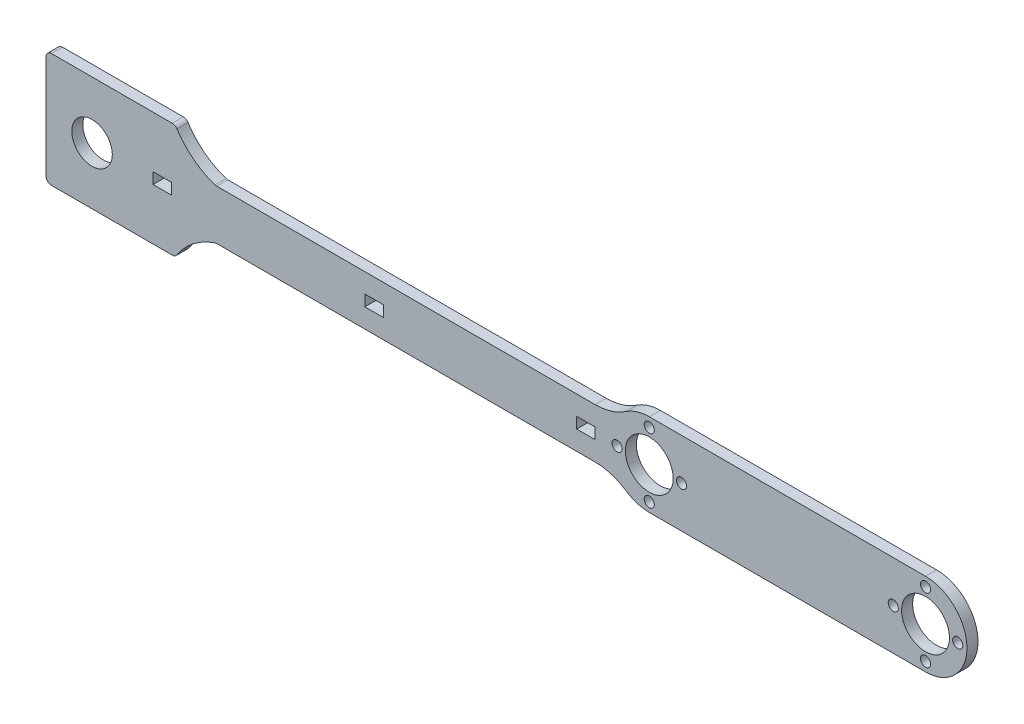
from build123d import *

# Parameters (mm, degrees)
SKETCH1_R           = 11
SKETCH1_R_2         = 13
SKETCH1_R_3         = 2.75
SKETCH1_W           = 10
SKETCH1_H           = 6
BOSS_EXTRUDE2_DEPTH = 6
FILLET1_R           = 3


with BuildPart() as part:
    # Sketch1 → Boss-Extrude2 (new body)
    with BuildSketch(Plane.XY):
        with BuildLine():
            Line((-250, 22.5), (-250, 31))
            Line((-250, 31), (-200, 31))
            Line((-200, 31), (-179.762709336, 31))
            ThreePointArc((-179.762709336, 31), (-170.371099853, 20.23024146), (-157.765788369, 13.5))
            Line((-157.765788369, 13.5), (48.133900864, 13.5))
            ThreePointArc((48.133900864, 13.5), (56.917001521, 14.814513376), (64.930401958, 18.642857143))
            ThreePointArc((64.930401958, 18.642857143), (70.940452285, 21.514114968), (77.527777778, 22.5))
            Line((77.527777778, 22.5), (227.527777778, 22.5))
            ThreePointArc((227.527777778, 22.5), (250.027777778, 0), (227.527777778, -22.5))
            Line((227.527777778, -22.5), (77.527777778, -22.5))
            ThreePointArc((77.527777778, -22.5), (70.940452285, -21.514114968), (64.930401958, -18.642857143))
            ThreePointArc((64.930401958, -18.642857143), (56.917001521, -14.814513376), (48.133900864, -13.5))
            Line((48.133900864, -13.5), (-157.765788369, -13.5))
            ThreePointArc((-157.765788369, -13.5), (-170.371099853, -20.23024146), (-179.762709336, -31))
            Line((-179.762709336, -31), (-200, -31))
            Line((-200, -31), (-250, -31))
            Line((-250, -31), (-250, -21))
            Line((-250, -21), (-250, 21))
            Line((-250, 21), (-250, 22.5))
        make_face()
        with Locations((-225, 0)):
            Circle(SKETCH1_R, mode=Mode.SUBTRACT)
        with Locations((227.527777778, 0)):
            Circle(SKETCH1_R_2, mode=Mode.SUBTRACT)
        with Locations((227.527777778, -17.5)):
            Circle(SKETCH1_R_3, mode=Mode.SUBTRACT)
        with Locations((210.027777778, 0)):
            Circle(SKETCH1_R_3, mode=Mode.SUBTRACT)
        with Locations((227.527777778, 17.5)):
            Circle(SKETCH1_R_3, mode=Mode.SUBTRACT)
        with Locations((245.027777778, 0)):
            Circle(SKETCH1_R_3, mode=Mode.SUBTRACT)
        with Locations(Location((60.027777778, 0, 0), (0, 0, 180))):
            Circle(SKETCH1_R_3, mode=Mode.SUBTRACT)
        with Locations(Location((77.527777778, 0, 0), (0, 0, 180))):
            Circle(SKETCH1_R_2, mode=Mode.SUBTRACT)
        with Locations(Location((77.527777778, -17.5, 0), (0, 0, 180))):
            Circle(SKETCH1_R_3, mode=Mode.SUBTRACT)
        with Locations(Location((95.027777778, 0, 0), (0, 0, 180))):
            Circle(SKETCH1_R_3, mode=Mode.SUBTRACT)
        with Locations(Location((77.527777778, 17.5, 0), (0, 0, 180))):
            Circle(SKETCH1_R_3, mode=Mode.SUBTRACT)
        with Locations((-186.866099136, 0)):
            Rectangle(SKETCH1_W, SKETCH1_H, mode=Mode.SUBTRACT)
        with Locations((43.133900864, 0)):
            Rectangle(SKETCH1_W, SKETCH1_H, mode=Mode.SUBTRACT)
        with Locations((-71.866099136, 0)):
            Rectangle(SKETCH1_W, SKETCH1_H, mode=Mode.SUBTRACT)
    extrude(amount=BOSS_EXTRUDE2_DEPTH)

    # Fillet1
    fillet1_edges = [part.edges().sort_by_distance(p)[0] for p in [
        (-250, 31, 3),
        (-179.762709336, 31, 3),
        (-157.765788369, 13.5, 3),
        (-157.765788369, -13.5, 3),
        (-179.762709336, -31, 3),
        (-250, -31, 3),
    ]]
    fillet(fillet1_edges, radius=FILLET1_R)


solid = part.part
